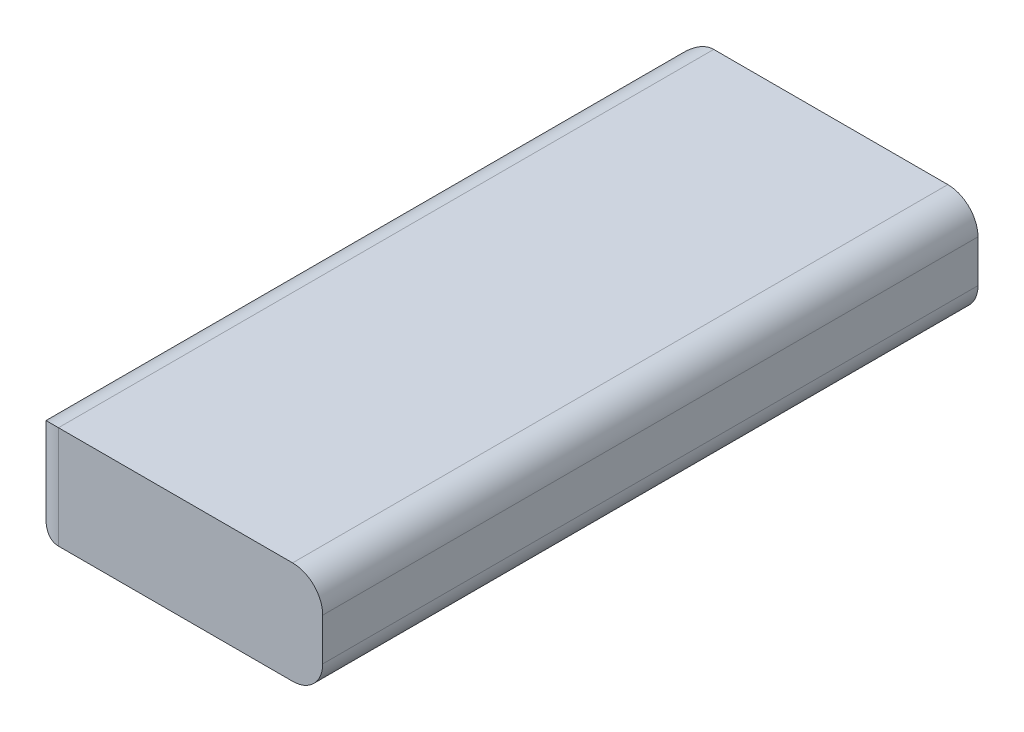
ISO-10303-21;
HEADER;
FILE_DESCRIPTION(('STEP AP214'),'2;1');
FILE_NAME('part.step','',(''),(''),'','','');
FILE_SCHEMA(('AUTOMOTIVE_DESIGN { 1 0 10303 214 1 1 1 1 }'));
ENDSEC;
DATA;
#1=APPLICATION_CONTEXT('core data for automotive mechanical design processes');
#2=APPLICATION_PROTOCOL_DEFINITION('international standard','automotive_design',2000,#1);
#3=PRODUCT_CONTEXT('',#1,'mechanical');
#4=PRODUCT('Part','Part','',(#3));
#5=PRODUCT_RELATED_PRODUCT_CATEGORY('part','',(#4));
#6=PRODUCT_DEFINITION_FORMATION('','',#4);
#7=PRODUCT_DEFINITION_CONTEXT('part definition',#1,'design');
#8=PRODUCT_DEFINITION('design','',#6,#7);
#9=PRODUCT_DEFINITION_SHAPE('','',#8);
#10=(LENGTH_UNIT() NAMED_UNIT(*) SI_UNIT(.MILLI.,.METRE.));
#11=(NAMED_UNIT(*) PLANE_ANGLE_UNIT() SI_UNIT($,.RADIAN.));
#12=(NAMED_UNIT(*) SI_UNIT($,.STERADIAN.) SOLID_ANGLE_UNIT());
#13=UNCERTAINTY_MEASURE_WITH_UNIT(LENGTH_MEASURE(1.E-05),#10,'distance_accuracy_value','');
#14=(GEOMETRIC_REPRESENTATION_CONTEXT(3) GLOBAL_UNCERTAINTY_ASSIGNED_CONTEXT((#13)) GLOBAL_UNIT_ASSIGNED_CONTEXT((#10,
#11,#12)) REPRESENTATION_CONTEXT('',''));
#15=CARTESIAN_POINT('',(0.,0.,0.));
#16=DIRECTION('',(0.,0.,1.));
#17=DIRECTION('',(1.,0.,0.));
#18=AXIS2_PLACEMENT_3D('',#15,#16,#17);
#19=CARTESIAN_POINT('',(0.,6.35000000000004,137.922));
#20=DIRECTION('',(1.,0.,0.));
#21=DIRECTION('',(0.,0.,-1.));
#22=AXIS2_PLACEMENT_3D('',#19,#20,#21);
#23=PLANE('',#22);
#24=DIRECTION('',(0.,0.,-1.));
#25=VECTOR('',#24,1.);
#26=CARTESIAN_POINT('',(0.,15.24,137.922));
#27=LINE('',#26,#25);
#28=CARTESIAN_POINT('',(0.,15.24,131.572));
#29=VERTEX_POINT('',#28);
#30=CARTESIAN_POINT('',(0.,15.24,5.90888016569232));
#31=VERTEX_POINT('',#30);
#32=EDGE_CURVE('E11',#29,#31,#27,.T.);
#33=ORIENTED_EDGE('',*,*,#32,.T.);
#34=DIRECTION('',(0.,1.,0.));
#35=VECTOR('',#34,1.);
#36=CARTESIAN_POINT('',(0.,0.,5.90888016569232));
#37=LINE('',#36,#35);
#38=CARTESIAN_POINT('',(0.,6.35000000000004,5.90888016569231));
#39=VERTEX_POINT('',#38);
#40=EDGE_CURVE('E161',#31,#39,#37,.F.);
#41=ORIENTED_EDGE('',*,*,#40,.T.);
#42=DIRECTION('',(0.,0.,-1.));
#43=VECTOR('',#42,1.);
#44=CARTESIAN_POINT('',(0.,6.35000000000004,137.922));
#45=LINE('',#44,#43);
#46=CARTESIAN_POINT('',(0.,6.35000000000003,131.572));
#47=VERTEX_POINT('',#46);
#48=EDGE_CURVE('E42',#47,#39,#45,.T.);
#49=ORIENTED_EDGE('',*,*,#48,.F.);
#50=DIRECTION('',(0.,1.,0.));
#51=VECTOR('',#50,1.);
#52=CARTESIAN_POINT('',(0.,0.,131.572));
#53=LINE('',#52,#51);
#54=EDGE_CURVE('E159',#47,#29,#53,.T.);
#55=ORIENTED_EDGE('',*,*,#54,.T.);
#56=EDGE_LOOP('',(#33,#41,#49,#55));
#57=FACE_BOUND('',#56,.T.);
#58=ADVANCED_FACE('F32',(#57),#23,.F.);
#59=CARTESIAN_POINT('',(6.35,15.24,137.922));
#60=DIRECTION('',(0.,0.,-1.));
#61=DIRECTION('',(-1.,0.,0.));
#62=AXIS2_PLACEMENT_3D('',#59,#60,#61);
#63=CYLINDRICAL_SURFACE('',#62,6.35);
#64=DIRECTION('',(0.,0.,-1.));
#65=VECTOR('',#64,1.);
#66=CARTESIAN_POINT('',(6.35000000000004,21.59,137.922));
#67=LINE('',#66,#65);
#68=CARTESIAN_POINT('',(6.34999999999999,21.59,137.922));
#69=VERTEX_POINT('',#68);
#70=CARTESIAN_POINT('',(6.35000000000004,21.59,0.));
#71=VERTEX_POINT('',#70);
#72=EDGE_CURVE('E124',#69,#71,#67,.T.);
#73=ORIENTED_EDGE('',*,*,#72,.T.);
#74=CARTESIAN_POINT('',(6.35000000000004,21.59,0.));
#75=CARTESIAN_POINT('',(6.20745470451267,21.5900367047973,-3.67280085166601E-05));
#76=CARTESIAN_POINT('',(6.06493361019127,21.5852018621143,0.00478572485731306));
#77=CARTESIAN_POINT('',(5.78127295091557,21.5660663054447,0.0238716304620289));
#78=CARTESIAN_POINT('',(5.64013239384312,21.551772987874,0.0381277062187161));
#79=CARTESIAN_POINT('',(5.3615214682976,21.5141565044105,0.075645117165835));
#80=CARTESIAN_POINT('',(5.22403016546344,21.490910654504,0.0988293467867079));
#81=CARTESIAN_POINT('',(4.95250212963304,21.4358604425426,0.153731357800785));
#82=CARTESIAN_POINT('',(4.81846589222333,21.4040548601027,0.185450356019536));
#83=CARTESIAN_POINT('',(4.55513905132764,21.3325799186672,0.256726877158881));
#84=CARTESIAN_POINT('',(4.42583482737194,21.2929356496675,0.296259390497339));
#85=CARTESIAN_POINT('',(4.17215830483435,21.2063629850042,0.382582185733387));
#86=CARTESIAN_POINT('',(4.04778789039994,21.1594318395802,0.429375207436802));
#87=CARTESIAN_POINT('',(3.68250090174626,21.0085674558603,0.579783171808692));
#88=CARTESIAN_POINT('',(3.44972376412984,20.8946512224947,0.693339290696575));
#89=CARTESIAN_POINT('',(2.91813019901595,20.5946486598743,0.992320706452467));
#90=CARTESIAN_POINT('',(2.63111078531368,20.3980785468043,1.18816695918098));
#91=CARTESIAN_POINT('',(2.23698133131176,20.0808871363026,1.50400955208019));
#92=CARTESIAN_POINT('',(2.11151637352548,19.9712590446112,1.61314329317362));
#93=CARTESIAN_POINT('',(1.87241052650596,19.7456273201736,1.83767570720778));
#94=CARTESIAN_POINT('',(1.75876965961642,19.6296236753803,1.95307439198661));
#95=CARTESIAN_POINT('',(1.50134681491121,19.346402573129,2.23468423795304));
#96=CARTESIAN_POINT('',(1.36289630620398,19.1767232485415,2.40329252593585));
#97=CARTESIAN_POINT('',(1.10727574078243,18.8292730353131,2.7482036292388));
#98=CARTESIAN_POINT('',(0.990115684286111,18.6514983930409,2.92451001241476));
#99=CARTESIAN_POINT('',(0.776303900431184,18.2896794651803,3.2827521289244));
#100=CARTESIAN_POINT('',(0.679641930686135,18.1056383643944,3.46468499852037));
#101=CARTESIAN_POINT('',(0.506004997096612,17.7325024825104,3.83251158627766));
#102=CARTESIAN_POINT('',(0.429021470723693,17.5434099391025,4.01840354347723));
#103=CARTESIAN_POINT('',(0.312246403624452,17.2123036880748,4.34198574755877));
#104=CARTESIAN_POINT('',(0.268022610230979,17.071331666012,4.4791691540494));
#105=CARTESIAN_POINT('',(0.189574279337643,16.787065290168,4.75360435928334));
#106=CARTESIAN_POINT('',(0.155335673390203,16.6437745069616,4.89085578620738));
#107=CARTESIAN_POINT('',(0.108431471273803,16.4118168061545,5.10880833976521));
#108=CARTESIAN_POINT('',(0.0926232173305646,16.3243127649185,5.19009311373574));
#109=CARTESIAN_POINT('',(0.064483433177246,16.1471255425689,5.35118028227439));
#110=CARTESIAN_POINT('',(0.0521563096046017,16.0574397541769,5.43098067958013));
#111=CARTESIAN_POINT('',(0.0340371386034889,15.8999144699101,5.56416833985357));
#112=CARTESIAN_POINT('',(0.0273828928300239,15.8330727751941,5.6186410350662));
#113=CARTESIAN_POINT('',(0.0159558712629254,15.6952240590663,5.72272118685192));
#114=CARTESIAN_POINT('',(0.0111815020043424,15.6242206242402,5.77233273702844));
#115=CARTESIAN_POINT('',(0.00598307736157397,15.5173491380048,5.83198663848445));
#116=CARTESIAN_POINT('',(0.00464524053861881,15.4851185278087,5.84823998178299));
#117=CARTESIAN_POINT('',(0.00243315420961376,15.4188404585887,5.87608876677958));
#118=CARTESIAN_POINT('',(0.00155542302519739,15.3848088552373,5.88771902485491));
#119=CARTESIAN_POINT('',(0.000641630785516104,15.3320238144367,5.9000403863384));
#120=CARTESIAN_POINT('',(0.000403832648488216,15.3138801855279,5.90330096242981));
#121=CARTESIAN_POINT('',(8.16880356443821E-05,15.2771697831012,5.90774647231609));
#122=CARTESIAN_POINT('',(-1.19088594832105E-06,15.258600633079,5.90891155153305));
#123=CARTESIAN_POINT('',(0.,15.24,5.90888016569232));
#124=B_SPLINE_CURVE_WITH_KNOTS('',3,(#74,#75,#76,#77,#78,#79,#80,#81,#82,#83,#84,#85,#86,#87,
#88,#89,#90,#91,#92,#93,#94,#95,#96,#97,#98,#99,#100,#101,#102,#103,#104,#105,#106,#107,#108,
#109,#110,#111,#112,#113,#114,#115,#116,#117,#118,#119,#120,#121,#122,#123),.UNSPECIFIED.,.F.,
.F.,(4,2,2,2,2,2,2,2,2,2,2,2,2,2,2,2,2,2,2,2,2,2,2,2,4),(0.,0.42743423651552,0.854534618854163,
1.27802631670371,1.70157842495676,2.12379615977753,2.54617361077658,3.3919333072,
4.58270855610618,5.17982704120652,5.77694665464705,6.60490555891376,7.43325235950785,
8.26118427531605,9.0887553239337,9.69336249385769,10.2971136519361,10.6585030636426,
11.020347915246,11.2798225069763,11.5390766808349,11.6472505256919,11.7545935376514,
11.8097867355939,11.8655001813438),.UNSPECIFIED.);
#125=EDGE_CURVE('E78',#71,#31,#124,.T.);
#126=ORIENTED_EDGE('',*,*,#125,.T.);
#127=ORIENTED_EDGE('',*,*,#32,.F.);
#128=CARTESIAN_POINT('',(6.34999999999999,15.24,131.572));
#129=DIRECTION('',(0.,0.707106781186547,-0.707106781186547));
#130=DIRECTION('',(0.,-0.707106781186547,-0.707106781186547));
#131=AXIS2_PLACEMENT_3D('',#128,#129,#130);
#132=ELLIPSE('',#131,8.98025612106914,6.34999999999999);
#133=EDGE_CURVE('E127',#29,#69,#132,.T.);
#134=ORIENTED_EDGE('',*,*,#133,.T.);
#135=EDGE_LOOP('',(#73,#126,#127,#134));
#136=FACE_BOUND('',#135,.T.);
#137=ADVANCED_FACE('F34',(#136),#63,.T.);
#138=CARTESIAN_POINT('',(6.35,6.35,137.922));
#139=DIRECTION('',(0.,0.,-1.));
#140=DIRECTION('',(-1.,0.,0.));
#141=AXIS2_PLACEMENT_3D('',#138,#139,#140);
#142=CYLINDRICAL_SURFACE('',#141,6.35);
#143=ORIENTED_EDGE('',*,*,#48,.T.);
#144=CARTESIAN_POINT('',(0.,6.35000000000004,5.90888016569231));
#145=CARTESIAN_POINT('',(-6.40577262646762E-06,6.31857322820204,5.9090534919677));
#146=CARTESIAN_POINT('',(0.000232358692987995,6.28743787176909,5.90564830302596));
#147=CARTESIAN_POINT('',(0.001124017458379,6.22694999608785,5.89348052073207));
#148=CARTESIAN_POINT('',(0.00176709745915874,6.19757281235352,5.88484506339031));
#149=CARTESIAN_POINT('',(0.00437797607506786,6.10581796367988,5.85124776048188));
#150=CARTESIAN_POINT('',(0.00700864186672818,6.04627224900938,5.81914454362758));
#151=CARTESIAN_POINT('',(0.0135859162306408,5.93076265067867,5.74750275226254));
#152=CARTESIAN_POINT('',(0.017559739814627,5.87490400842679,5.70781846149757));
#153=CARTESIAN_POINT('',(0.0271858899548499,5.75993524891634,5.62080035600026));
#154=CARTESIAN_POINT('',(0.032971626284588,5.70110952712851,5.57310171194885));
#155=CARTESIAN_POINT('',(0.0459536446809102,5.58521700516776,5.47578365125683));
#156=CARTESIAN_POINT('',(0.0531509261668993,5.52815148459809,5.42616289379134));
#157=CARTESIAN_POINT('',(0.0768554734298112,5.35840811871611,5.27567284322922));
#158=CARTESIAN_POINT('',(0.0954615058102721,5.24734366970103,5.17330717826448));
#159=CARTESIAN_POINT('',(0.138101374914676,5.02820856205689,4.9681991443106));
#160=CARTESIAN_POINT('',(0.162094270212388,4.92012188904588,4.86546508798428));
#161=CARTESIAN_POINT('',(0.215614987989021,4.70560569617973,4.65986756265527));
#162=CARTESIAN_POINT('',(0.245139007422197,4.59917509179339,4.55700423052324));
#163=CARTESIAN_POINT('',(0.343032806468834,4.27897129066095,4.2461198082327));
#164=CARTESIAN_POINT('',(0.42014752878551,4.06726278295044,4.0386424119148));
#165=CARTESIAN_POINT('',(0.598303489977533,3.64962439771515,3.62783529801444));
#166=CARTESIAN_POINT('',(0.699362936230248,3.4436990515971,3.42450886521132));
#167=CARTESIAN_POINT('',(0.926565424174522,3.03899144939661,3.02411849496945));
#168=CARTESIAN_POINT('',(1.05274174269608,2.84021908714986,2.82706327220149));
#169=CARTESIAN_POINT('',(1.33116427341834,2.45247337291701,2.44223997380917));
#170=CARTESIAN_POINT('',(1.48339043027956,2.26349262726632,2.25446489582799));
#171=CARTESIAN_POINT('',(1.8538871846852,1.85555621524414,1.84885226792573));
#172=CARTESIAN_POINT('',(2.07928580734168,1.63982887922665,1.63415772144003));
#173=CARTESIAN_POINT('',(2.57334992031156,1.23520654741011,1.23127805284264));
#174=CARTESIAN_POINT('',(2.84193528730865,1.04626305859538,1.04304502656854));
#175=CARTESIAN_POINT('',(3.36596670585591,0.738285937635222,0.73613797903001));
#176=CARTESIAN_POINT('',(3.61376415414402,0.612804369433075,0.611057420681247));
#177=CARTESIAN_POINT('',(4.00428208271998,0.447449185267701,0.446206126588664));
#178=CARTESIAN_POINT('',(4.13750105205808,0.396167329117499,0.395075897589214));
#179=CARTESIAN_POINT('',(4.4096934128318,0.301990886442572,0.301172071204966));
#180=CARTESIAN_POINT('',(4.54866385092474,0.259092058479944,0.258394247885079));
#181=CARTESIAN_POINT('',(4.82173525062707,0.185139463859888,0.18464688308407));
#182=CARTESIAN_POINT('',(4.95550355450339,0.153469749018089,0.15306336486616));
#183=CARTESIAN_POINT('',(5.22646971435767,0.0986572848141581,0.0983984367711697));
#184=CARTESIAN_POINT('',(5.3636668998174,0.0755128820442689,0.0753153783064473));
#185=CARTESIAN_POINT('',(5.64167635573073,0.0380603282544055,0.0379614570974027));
#186=CARTESIAN_POINT('',(5.78250952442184,0.0238295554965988,0.0237677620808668));
#187=CARTESIAN_POINT('',(6.0655530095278,0.00477735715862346,0.00476499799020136));
#188=CARTESIAN_POINT('',(6.20776436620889,-3.62962390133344E-05,-3.63193210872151E-05));
#189=CARTESIAN_POINT('',(6.35000000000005,0.,0.));
#190=B_SPLINE_CURVE_WITH_KNOTS('',3,(#144,#145,#146,#147,#148,#149,#150,#151,#152,#153,#154,
#155,#156,#157,#158,#159,#160,#161,#162,#163,#164,#165,#166,#167,#168,#169,#170,#171,#172,#173,
#174,#175,#176,#177,#178,#179,#180,#181,#182,#183,#184,#185,#186,#187,#188,#189),.UNSPECIFIED.,
.F.,.F.,(4,2,2,2,2,2,2,2,2,2,2,2,2,2,2,2,2,2,2,2,2,2,4),(0.,0.093638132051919,0.185086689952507,
0.386588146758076,0.592445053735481,0.820156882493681,1.04803052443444,1.50439997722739,
1.95741175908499,2.4101131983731,3.32794271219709,4.24647238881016,5.16622720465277,
6.08527707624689,7.21771859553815,8.34808286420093,9.2580531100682,9.71246100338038,
10.1666383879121,10.589255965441,11.011791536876,11.4379460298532,11.864452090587),.UNSPECIFIED.);
#191=CARTESIAN_POINT('',(6.35000000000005,0.,0.));
#192=VERTEX_POINT('',#191);
#193=EDGE_CURVE('E152',#39,#192,#190,.T.);
#194=ORIENTED_EDGE('',*,*,#193,.T.);
#195=DIRECTION('',(0.,0.,-1.));
#196=VECTOR('',#195,1.);
#197=CARTESIAN_POINT('',(6.35000000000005,0.,137.922));
#198=LINE('',#197,#196);
#199=CARTESIAN_POINT('',(6.35000000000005,0.,137.922));
#200=VERTEX_POINT('',#199);
#201=EDGE_CURVE('E141',#200,#192,#198,.T.);
#202=ORIENTED_EDGE('',*,*,#201,.F.);
#203=CARTESIAN_POINT('',(6.34999999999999,6.35,131.572));
#204=DIRECTION('',(0.,-0.707106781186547,-0.707106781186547));
#205=DIRECTION('',(0.,0.707106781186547,-0.707106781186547));
#206=AXIS2_PLACEMENT_3D('',#203,#204,#205);
#207=ELLIPSE('',#206,8.98025612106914,6.34999999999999);
#208=EDGE_CURVE('E87',#200,#47,#207,.T.);
#209=ORIENTED_EDGE('',*,*,#208,.T.);
#210=EDGE_LOOP('',(#143,#194,#202,#209));
#211=FACE_BOUND('',#210,.T.);
#212=ADVANCED_FACE('F148',(#211),#142,.T.);
#213=CARTESIAN_POINT('',(6.35000000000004,0.,137.922));
#214=DIRECTION('',(0.,1.,0.));
#215=DIRECTION('',(0.,0.,1.));
#216=AXIS2_PLACEMENT_3D('',#213,#214,#215);
#217=PLANE('',#216);
#218=DIRECTION('',(1.,0.,0.));
#219=VECTOR('',#218,1.);
#220=CARTESIAN_POINT('',(6.35000000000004,0.,0.));
#221=LINE('',#220,#219);
#222=CARTESIAN_POINT('',(55.626,0.,0.));
#223=VERTEX_POINT('',#222);
#224=EDGE_CURVE('E125',#192,#223,#221,.T.);
#225=ORIENTED_EDGE('',*,*,#224,.T.);
#226=DIRECTION('',(0.,0.,-1.));
#227=VECTOR('',#226,1.);
#228=CARTESIAN_POINT('',(55.626,0.,137.922));
#229=LINE('',#228,#227);
#230=CARTESIAN_POINT('',(55.626,0.,137.922));
#231=VERTEX_POINT('',#230);
#232=EDGE_CURVE('E114',#231,#223,#229,.T.);
#233=ORIENTED_EDGE('',*,*,#232,.F.);
#234=DIRECTION('',(1.,0.,0.));
#235=VECTOR('',#234,1.);
#236=CARTESIAN_POINT('',(6.35000000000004,0.,137.922));
#237=LINE('',#236,#235);
#238=EDGE_CURVE('E102',#200,#231,#237,.T.);
#239=ORIENTED_EDGE('',*,*,#238,.F.);
#240=ORIENTED_EDGE('',*,*,#201,.T.);
#241=EDGE_LOOP('',(#225,#233,#239,#240));
#242=FACE_BOUND('',#241,.T.);
#243=ADVANCED_FACE('F220',(#242),#217,.F.);
#244=CARTESIAN_POINT('',(55.626,6.35,137.922));
#245=DIRECTION('',(0.,0.,-1.));
#246=DIRECTION('',(-1.,0.,0.));
#247=AXIS2_PLACEMENT_3D('',#244,#245,#246);
#248=CYLINDRICAL_SURFACE('',#247,6.35);
#249=CARTESIAN_POINT('',(55.626,6.35,0.));
#250=DIRECTION('',(0.,0.,1.));
#251=DIRECTION('',(1.,0.,0.));
#252=AXIS2_PLACEMENT_3D('',#249,#250,#251);
#253=CIRCLE('',#252,6.35);
#254=CARTESIAN_POINT('',(61.976,6.35,0.));
#255=VERTEX_POINT('',#254);
#256=EDGE_CURVE('E111',#223,#255,#253,.T.);
#257=ORIENTED_EDGE('',*,*,#256,.T.);
#258=DIRECTION('',(0.,0.,-1.));
#259=VECTOR('',#258,1.);
#260=CARTESIAN_POINT('',(61.976,6.35,137.922));
#261=LINE('',#260,#259);
#262=CARTESIAN_POINT('',(61.976,6.35,137.922));
#263=VERTEX_POINT('',#262);
#264=EDGE_CURVE('E108',#263,#255,#261,.T.);
#265=ORIENTED_EDGE('',*,*,#264,.F.);
#266=CARTESIAN_POINT('',(55.626,6.35,137.922));
#267=DIRECTION('',(0.,0.,1.));
#268=DIRECTION('',(1.,0.,0.));
#269=AXIS2_PLACEMENT_3D('',#266,#267,#268);
#270=CIRCLE('',#269,6.35);
#271=EDGE_CURVE('E95',#231,#263,#270,.T.);
#272=ORIENTED_EDGE('',*,*,#271,.F.);
#273=ORIENTED_EDGE('',*,*,#232,.T.);
#274=EDGE_LOOP('',(#257,#265,#272,#273));
#275=FACE_BOUND('',#274,.T.);
#276=ADVANCED_FACE('F109',(#275),#248,.T.);
#277=CARTESIAN_POINT('',(61.976,6.35000000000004,137.922));
#278=DIRECTION('',(-1.,0.,0.));
#279=DIRECTION('',(0.,0.,1.));
#280=AXIS2_PLACEMENT_3D('',#277,#278,#279);
#281=PLANE('',#280);
#282=DIRECTION('',(0.,1.,0.));
#283=VECTOR('',#282,1.);
#284=CARTESIAN_POINT('',(61.976,6.35000000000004,0.));
#285=LINE('',#284,#283);
#286=CARTESIAN_POINT('',(61.976,15.24,0.));
#287=VERTEX_POINT('',#286);
#288=EDGE_CURVE('E129',#255,#287,#285,.T.);
#289=ORIENTED_EDGE('',*,*,#288,.T.);
#290=DIRECTION('',(0.,0.,-1.));
#291=VECTOR('',#290,1.);
#292=CARTESIAN_POINT('',(61.976,15.24,137.922));
#293=LINE('',#292,#291);
#294=CARTESIAN_POINT('',(61.976,15.24,137.922));
#295=VERTEX_POINT('',#294);
#296=EDGE_CURVE('E115',#295,#287,#293,.T.);
#297=ORIENTED_EDGE('',*,*,#296,.F.);
#298=DIRECTION('',(0.,1.,0.));
#299=VECTOR('',#298,1.);
#300=CARTESIAN_POINT('',(61.976,6.35000000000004,137.922));
#301=LINE('',#300,#299);
#302=EDGE_CURVE('E99',#263,#295,#301,.T.);
#303=ORIENTED_EDGE('',*,*,#302,.F.);
#304=ORIENTED_EDGE('',*,*,#264,.T.);
#305=EDGE_LOOP('',(#289,#297,#303,#304));
#306=FACE_BOUND('',#305,.T.);
#307=ADVANCED_FACE('F117',(#306),#281,.F.);
#308=CARTESIAN_POINT('',(55.626,15.24,137.922));
#309=DIRECTION('',(0.,0.,-1.));
#310=DIRECTION('',(-1.,0.,0.));
#311=AXIS2_PLACEMENT_3D('',#308,#309,#310);
#312=CYLINDRICAL_SURFACE('',#311,6.35);
#313=CARTESIAN_POINT('',(55.626,15.24,0.));
#314=DIRECTION('',(0.,0.,1.));
#315=DIRECTION('',(-1.,0.,0.));
#316=AXIS2_PLACEMENT_3D('',#313,#314,#315);
#317=CIRCLE('',#316,6.35);
#318=CARTESIAN_POINT('',(55.626,21.59,0.));
#319=VERTEX_POINT('',#318);
#320=EDGE_CURVE('E70',#287,#319,#317,.T.);
#321=ORIENTED_EDGE('',*,*,#320,.T.);
#322=DIRECTION('',(0.,0.,-1.));
#323=VECTOR('',#322,1.);
#324=CARTESIAN_POINT('',(55.626,21.59,137.922));
#325=LINE('',#324,#323);
#326=CARTESIAN_POINT('',(55.626,21.59,137.922));
#327=VERTEX_POINT('',#326);
#328=EDGE_CURVE('E137',#327,#319,#325,.T.);
#329=ORIENTED_EDGE('',*,*,#328,.F.);
#330=CARTESIAN_POINT('',(55.626,15.24,137.922));
#331=DIRECTION('',(0.,0.,1.));
#332=DIRECTION('',(-1.,0.,0.));
#333=AXIS2_PLACEMENT_3D('',#330,#331,#332);
#334=CIRCLE('',#333,6.35);
#335=EDGE_CURVE('E50',#295,#327,#334,.T.);
#336=ORIENTED_EDGE('',*,*,#335,.F.);
#337=ORIENTED_EDGE('',*,*,#296,.T.);
#338=EDGE_LOOP('',(#321,#329,#336,#337));
#339=FACE_BOUND('',#338,.T.);
#340=ADVANCED_FACE('F204',(#339),#312,.T.);
#341=CARTESIAN_POINT('',(6.35000000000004,21.59,137.922));
#342=DIRECTION('',(0.,-1.,0.));
#343=DIRECTION('',(0.,0.,-1.));
#344=AXIS2_PLACEMENT_3D('',#341,#342,#343);
#345=PLANE('',#344);
#346=DIRECTION('',(-1.,0.,0.));
#347=VECTOR('',#346,1.);
#348=CARTESIAN_POINT('',(6.35000000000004,21.59,0.));
#349=LINE('',#348,#347);
#350=EDGE_CURVE('E132',#319,#71,#349,.T.);
#351=ORIENTED_EDGE('',*,*,#350,.T.);
#352=ORIENTED_EDGE('',*,*,#72,.F.);
#353=DIRECTION('',(-1.,0.,0.));
#354=VECTOR('',#353,1.);
#355=CARTESIAN_POINT('',(6.35000000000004,21.59,137.922));
#356=LINE('',#355,#354);
#357=EDGE_CURVE('E119',#327,#69,#356,.T.);
#358=ORIENTED_EDGE('',*,*,#357,.F.);
#359=ORIENTED_EDGE('',*,*,#328,.T.);
#360=EDGE_LOOP('',(#351,#352,#358,#359));
#361=FACE_BOUND('',#360,.T.);
#362=ADVANCED_FACE('F202',(#361),#345,.F.);
#363=CARTESIAN_POINT('',(6.35,15.24,137.922));
#364=DIRECTION('',(0.,0.,-1.));
#365=DIRECTION('',(-1.,0.,0.));
#366=AXIS2_PLACEMENT_3D('',#363,#364,#365);
#367=PLANE('',#366);
#368=ORIENTED_EDGE('',*,*,#357,.T.);
#369=DIRECTION('',(0.,1.,0.));
#370=VECTOR('',#369,1.);
#371=CARTESIAN_POINT('',(6.34999999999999,0.,137.922));
#372=LINE('',#371,#370);
#373=EDGE_CURVE('E193',#200,#69,#372,.T.);
#374=ORIENTED_EDGE('',*,*,#373,.F.);
#375=ORIENTED_EDGE('',*,*,#238,.T.);
#376=ORIENTED_EDGE('',*,*,#271,.T.);
#377=ORIENTED_EDGE('',*,*,#302,.T.);
#378=ORIENTED_EDGE('',*,*,#335,.T.);
#379=EDGE_LOOP('',(#368,#374,#375,#376,#377,#378));
#380=FACE_BOUND('',#379,.T.);
#381=ADVANCED_FACE('F97',(#380),#367,.F.);
#382=CARTESIAN_POINT('',(6.35,15.24,0.));
#383=DIRECTION('',(0.,0.,-1.));
#384=DIRECTION('',(-1.,0.,0.));
#385=AXIS2_PLACEMENT_3D('',#382,#383,#384);
#386=PLANE('',#385);
#387=DIRECTION('',(0.,1.,0.));
#388=VECTOR('',#387,1.);
#389=CARTESIAN_POINT('',(6.35000000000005,0.,0.));
#390=LINE('',#389,#388);
#391=EDGE_CURVE('E167',#192,#71,#390,.T.);
#392=ORIENTED_EDGE('',*,*,#391,.T.);
#393=ORIENTED_EDGE('',*,*,#350,.F.);
#394=ORIENTED_EDGE('',*,*,#320,.F.);
#395=ORIENTED_EDGE('',*,*,#288,.F.);
#396=ORIENTED_EDGE('',*,*,#256,.F.);
#397=ORIENTED_EDGE('',*,*,#224,.F.);
#398=EDGE_LOOP('',(#392,#393,#394,#395,#396,#397));
#399=FACE_BOUND('',#398,.T.);
#400=ADVANCED_FACE('F203',(#399),#386,.T.);
#401=CARTESIAN_POINT('',(6.34999999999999,0.,131.572));
#402=DIRECTION('',(0.,1.,0.));
#403=DIRECTION('',(0.,0.,1.));
#404=AXIS2_PLACEMENT_3D('',#401,#402,#403);
#405=CYLINDRICAL_SURFACE('',#404,6.34999999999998);
#406=ORIENTED_EDGE('',*,*,#54,.F.);
#407=ORIENTED_EDGE('',*,*,#208,.F.);
#408=ORIENTED_EDGE('',*,*,#373,.T.);
#409=ORIENTED_EDGE('',*,*,#133,.F.);
#410=EDGE_LOOP('',(#406,#407,#408,#409));
#411=FACE_BOUND('',#410,.T.);
#412=ADVANCED_FACE('F186',(#411),#405,.T.);
#413=CARTESIAN_POINT('',(6.35000000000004,0.,6.36646561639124));
#414=DIRECTION('',(0.,1.,0.));
#415=DIRECTION('',(0.,0.,1.));
#416=AXIS2_PLACEMENT_3D('',#413,#414,#415);
#417=CYLINDRICAL_SURFACE('',#416,6.36646561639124);
#418=ORIENTED_EDGE('',*,*,#391,.F.);
#419=ORIENTED_EDGE('',*,*,#193,.F.);
#420=ORIENTED_EDGE('',*,*,#40,.F.);
#421=ORIENTED_EDGE('',*,*,#125,.F.);
#422=EDGE_LOOP('',(#418,#419,#420,#421));
#423=FACE_BOUND('',#422,.T.);
#424=ADVANCED_FACE('F168',(#423),#417,.T.);
#425=CLOSED_SHELL('',(#58,#137,#212,#243,#276,#307,#340,#362,#381,#400,#412,#424));
#426=MANIFOLD_SOLID_BREP('B2',#425);
#427=ADVANCED_BREP_SHAPE_REPRESENTATION('',(#18,#426),#14);
#428=SHAPE_DEFINITION_REPRESENTATION(#9,#427);
ENDSEC;
END-ISO-10303-21;
